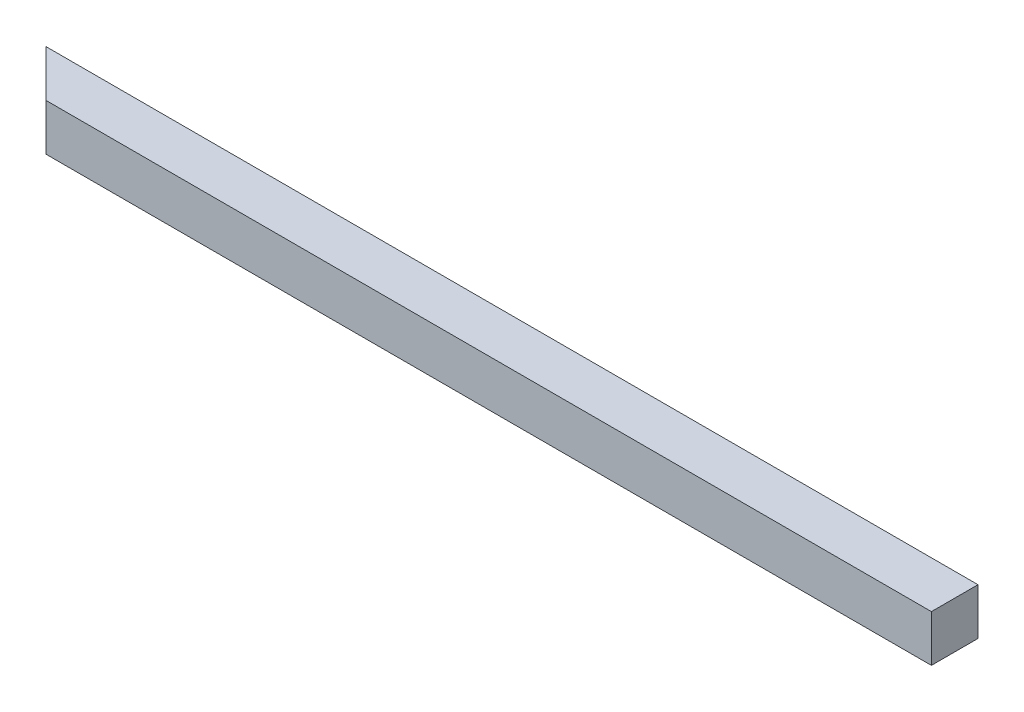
ISO-10303-21;
HEADER;
FILE_DESCRIPTION(('STEP AP214'),'2;1');
FILE_NAME('part.step','',(''),(''),'','','');
FILE_SCHEMA(('AUTOMOTIVE_DESIGN { 1 0 10303 214 1 1 1 1 }'));
ENDSEC;
DATA;
#1=APPLICATION_CONTEXT('core data for automotive mechanical design processes');
#2=APPLICATION_PROTOCOL_DEFINITION('international standard','automotive_design',2000,#1);
#3=PRODUCT_CONTEXT('',#1,'mechanical');
#4=PRODUCT('Part','Part','',(#3));
#5=PRODUCT_RELATED_PRODUCT_CATEGORY('part','',(#4));
#6=PRODUCT_DEFINITION_FORMATION('','',#4);
#7=PRODUCT_DEFINITION_CONTEXT('part definition',#1,'design');
#8=PRODUCT_DEFINITION('design','',#6,#7);
#9=PRODUCT_DEFINITION_SHAPE('','',#8);
#10=(LENGTH_UNIT() NAMED_UNIT(*) SI_UNIT(.MILLI.,.METRE.));
#11=(NAMED_UNIT(*) PLANE_ANGLE_UNIT() SI_UNIT($,.RADIAN.));
#12=(NAMED_UNIT(*) SI_UNIT($,.STERADIAN.) SOLID_ANGLE_UNIT());
#13=UNCERTAINTY_MEASURE_WITH_UNIT(LENGTH_MEASURE(1.E-05),#10,'distance_accuracy_value','');
#14=(GEOMETRIC_REPRESENTATION_CONTEXT(3) GLOBAL_UNCERTAINTY_ASSIGNED_CONTEXT((#13)) GLOBAL_UNIT_ASSIGNED_CONTEXT((#10,
#11,#12)) REPRESENTATION_CONTEXT('',''));
#15=CARTESIAN_POINT('',(0.,0.,0.));
#16=DIRECTION('',(0.,0.,1.));
#17=DIRECTION('',(1.,0.,0.));
#18=AXIS2_PLACEMENT_3D('',#15,#16,#17);
#19=CARTESIAN_POINT('',(200.,20.,-10.));
#20=DIRECTION('',(-1.,0.,0.));
#21=DIRECTION('',(0.,0.,1.));
#22=AXIS2_PLACEMENT_3D('',#19,#20,#21);
#23=PLANE('',#22);
#24=DIRECTION('',(0.,0.,-1.));
#25=VECTOR('',#24,1.);
#26=CARTESIAN_POINT('',(200.,0.,-10.));
#27=LINE('',#26,#25);
#28=CARTESIAN_POINT('',(200.,0.,9.99999999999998));
#29=VERTEX_POINT('',#28);
#30=CARTESIAN_POINT('',(200.,0.,-10.));
#31=VERTEX_POINT('',#30);
#32=EDGE_CURVE('E96',#29,#31,#27,.T.);
#33=ORIENTED_EDGE('',*,*,#32,.T.);
#34=DIRECTION('',(0.,-1.,0.));
#35=VECTOR('',#34,1.);
#36=CARTESIAN_POINT('',(200.,20.,-10.));
#37=LINE('',#36,#35);
#38=CARTESIAN_POINT('',(200.,20.,-10.));
#39=VERTEX_POINT('',#38);
#40=EDGE_CURVE('E11',#39,#31,#37,.T.);
#41=ORIENTED_EDGE('',*,*,#40,.F.);
#42=DIRECTION('',(0.,0.,-1.));
#43=VECTOR('',#42,1.);
#44=CARTESIAN_POINT('',(200.,20.,-10.));
#45=LINE('',#44,#43);
#46=CARTESIAN_POINT('',(200.,20.,9.99999999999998));
#47=VERTEX_POINT('',#46);
#48=EDGE_CURVE('E84',#47,#39,#45,.T.);
#49=ORIENTED_EDGE('',*,*,#48,.F.);
#50=DIRECTION('',(0.,-1.,0.));
#51=VECTOR('',#50,1.);
#52=CARTESIAN_POINT('',(200.,20.,9.99999999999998));
#53=LINE('',#52,#51);
#54=EDGE_CURVE('E92',#47,#29,#53,.T.);
#55=ORIENTED_EDGE('',*,*,#54,.T.);
#56=EDGE_LOOP('',(#33,#41,#49,#55));
#57=FACE_BOUND('',#56,.T.);
#58=ADVANCED_FACE('F33',(#57),#23,.F.);
#59=CARTESIAN_POINT('',(-200.,20.,-10.));
#60=DIRECTION('',(0.,0.,1.));
#61=DIRECTION('',(1.,0.,0.));
#62=AXIS2_PLACEMENT_3D('',#59,#60,#61);
#63=PLANE('',#62);
#64=DIRECTION('',(-1.,0.,0.));
#65=VECTOR('',#64,1.);
#66=CARTESIAN_POINT('',(-200.,0.,-10.));
#67=LINE('',#66,#65);
#68=CARTESIAN_POINT('',(-200.,0.,-10.));
#69=VERTEX_POINT('',#68);
#70=EDGE_CURVE('E88',#31,#69,#67,.T.);
#71=ORIENTED_EDGE('',*,*,#70,.T.);
#72=DIRECTION('',(0.,-1.,0.));
#73=VECTOR('',#72,1.);
#74=CARTESIAN_POINT('',(-200.,20.,-10.));
#75=LINE('',#74,#73);
#76=CARTESIAN_POINT('',(-200.,20.,-10.));
#77=VERTEX_POINT('',#76);
#78=EDGE_CURVE('E41',#77,#69,#75,.T.);
#79=ORIENTED_EDGE('',*,*,#78,.F.);
#80=DIRECTION('',(-1.,0.,0.));
#81=VECTOR('',#80,1.);
#82=CARTESIAN_POINT('',(-200.,20.,-10.));
#83=LINE('',#82,#81);
#84=EDGE_CURVE('E79',#39,#77,#83,.T.);
#85=ORIENTED_EDGE('',*,*,#84,.F.);
#86=ORIENTED_EDGE('',*,*,#40,.T.);
#87=EDGE_LOOP('',(#71,#79,#85,#86));
#88=FACE_BOUND('',#87,.T.);
#89=ADVANCED_FACE('F87',(#88),#63,.F.);
#90=CARTESIAN_POINT('',(-200.,20.,-10.));
#91=DIRECTION('',(0.707106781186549,0.,-0.707106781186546));
#92=DIRECTION('',(-0.707106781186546,0.,-0.707106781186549));
#93=AXIS2_PLACEMENT_3D('',#90,#91,#92);
#94=PLANE('',#93);
#95=DIRECTION('',(0.707106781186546,0.,0.707106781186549));
#96=VECTOR('',#95,1.);
#97=CARTESIAN_POINT('',(-200.,0.,-10.));
#98=LINE('',#97,#96);
#99=CARTESIAN_POINT('',(-180.,0.,9.99999999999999));
#100=VERTEX_POINT('',#99);
#101=EDGE_CURVE('E66',#69,#100,#98,.T.);
#102=ORIENTED_EDGE('',*,*,#101,.T.);
#103=DIRECTION('',(0.,-1.,0.));
#104=VECTOR('',#103,1.);
#105=CARTESIAN_POINT('',(-180.,20.,9.99999999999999));
#106=LINE('',#105,#104);
#107=CARTESIAN_POINT('',(-180.,20.,9.99999999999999));
#108=VERTEX_POINT('',#107);
#109=EDGE_CURVE('E89',#108,#100,#106,.T.);
#110=ORIENTED_EDGE('',*,*,#109,.F.);
#111=DIRECTION('',(0.707106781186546,0.,0.707106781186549));
#112=VECTOR('',#111,1.);
#113=CARTESIAN_POINT('',(-200.,20.,-10.));
#114=LINE('',#113,#112);
#115=EDGE_CURVE('E82',#77,#108,#114,.T.);
#116=ORIENTED_EDGE('',*,*,#115,.F.);
#117=ORIENTED_EDGE('',*,*,#78,.T.);
#118=EDGE_LOOP('',(#102,#110,#116,#117));
#119=FACE_BOUND('',#118,.T.);
#120=ADVANCED_FACE('F90',(#119),#94,.F.);
#121=CARTESIAN_POINT('',(-180.,20.,9.99999999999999));
#122=DIRECTION('',(0.,0.,-1.));
#123=DIRECTION('',(-1.,0.,0.));
#124=AXIS2_PLACEMENT_3D('',#121,#122,#123);
#125=PLANE('',#124);
#126=DIRECTION('',(1.,0.,0.));
#127=VECTOR('',#126,1.);
#128=CARTESIAN_POINT('',(-180.,0.,9.99999999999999));
#129=LINE('',#128,#127);
#130=EDGE_CURVE('E72',#100,#29,#129,.T.);
#131=ORIENTED_EDGE('',*,*,#130,.T.);
#132=ORIENTED_EDGE('',*,*,#54,.F.);
#133=DIRECTION('',(1.,0.,0.));
#134=VECTOR('',#133,1.);
#135=CARTESIAN_POINT('',(-180.,20.,9.99999999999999));
#136=LINE('',#135,#134);
#137=EDGE_CURVE('E49',#108,#47,#136,.T.);
#138=ORIENTED_EDGE('',*,*,#137,.F.);
#139=ORIENTED_EDGE('',*,*,#109,.T.);
#140=EDGE_LOOP('',(#131,#132,#138,#139));
#141=FACE_BOUND('',#140,.T.);
#142=ADVANCED_FACE('F103',(#141),#125,.F.);
#143=CARTESIAN_POINT('',(0.,20.,0.));
#144=DIRECTION('',(0.,1.,0.));
#145=DIRECTION('',(0.,0.,1.));
#146=AXIS2_PLACEMENT_3D('',#143,#144,#145);
#147=PLANE('',#146);
#148=ORIENTED_EDGE('',*,*,#48,.T.);
#149=ORIENTED_EDGE('',*,*,#84,.T.);
#150=ORIENTED_EDGE('',*,*,#115,.T.);
#151=ORIENTED_EDGE('',*,*,#137,.T.);
#152=EDGE_LOOP('',(#148,#149,#150,#151));
#153=FACE_BOUND('',#152,.T.);
#154=ADVANCED_FACE('F80',(#153),#147,.T.);
#155=CARTESIAN_POINT('',(0.,0.,0.));
#156=DIRECTION('',(0.,1.,0.));
#157=DIRECTION('',(0.,0.,1.));
#158=AXIS2_PLACEMENT_3D('',#155,#156,#157);
#159=PLANE('',#158);
#160=ORIENTED_EDGE('',*,*,#32,.F.);
#161=ORIENTED_EDGE('',*,*,#130,.F.);
#162=ORIENTED_EDGE('',*,*,#101,.F.);
#163=ORIENTED_EDGE('',*,*,#70,.F.);
#164=EDGE_LOOP('',(#160,#161,#162,#163));
#165=FACE_BOUND('',#164,.T.);
#166=ADVANCED_FACE('F106',(#165),#159,.F.);
#167=CLOSED_SHELL('',(#58,#89,#120,#142,#154,#166));
#168=MANIFOLD_SOLID_BREP('B2',#167);
#169=ADVANCED_BREP_SHAPE_REPRESENTATION('',(#18,#168),#14);
#170=SHAPE_DEFINITION_REPRESENTATION(#9,#169);
ENDSEC;
END-ISO-10303-21;
